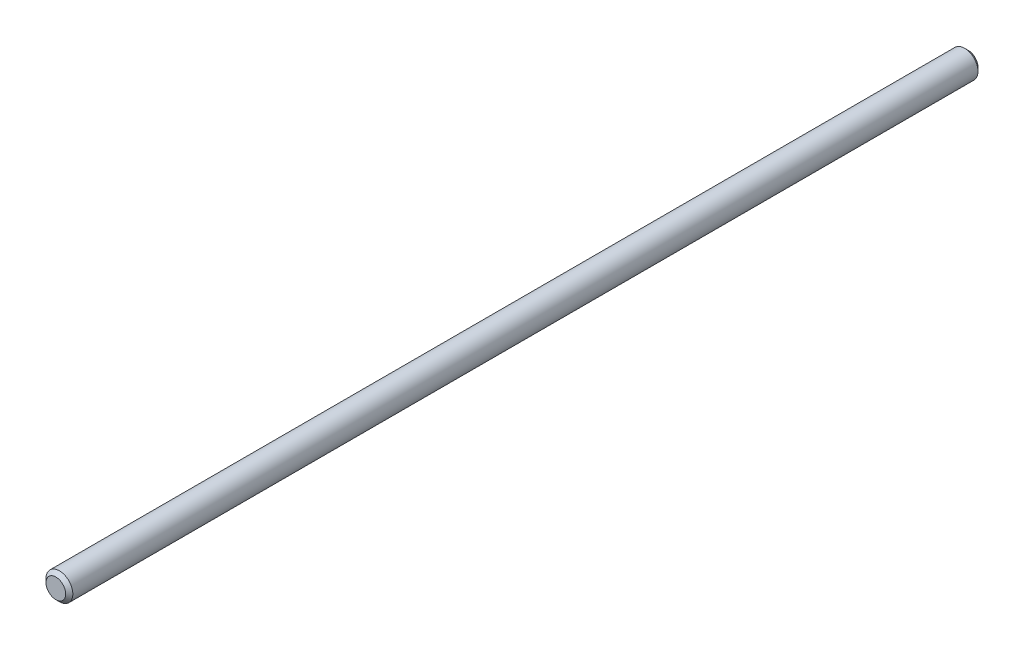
ISO-10303-21;
HEADER;
FILE_DESCRIPTION(('STEP AP214'),'2;1');
FILE_NAME('part.step','',(''),(''),'','','');
FILE_SCHEMA(('AUTOMOTIVE_DESIGN { 1 0 10303 214 1 1 1 1 }'));
ENDSEC;
DATA;
#1=APPLICATION_CONTEXT('core data for automotive mechanical design processes');
#2=APPLICATION_PROTOCOL_DEFINITION('international standard','automotive_design',2000,#1);
#3=PRODUCT_CONTEXT('',#1,'mechanical');
#4=PRODUCT('Part','Part','',(#3));
#5=PRODUCT_RELATED_PRODUCT_CATEGORY('part','',(#4));
#6=PRODUCT_DEFINITION_FORMATION('','',#4);
#7=PRODUCT_DEFINITION_CONTEXT('part definition',#1,'design');
#8=PRODUCT_DEFINITION('design','',#6,#7);
#9=PRODUCT_DEFINITION_SHAPE('','',#8);
#10=(LENGTH_UNIT() NAMED_UNIT(*) SI_UNIT(.MILLI.,.METRE.));
#11=(NAMED_UNIT(*) PLANE_ANGLE_UNIT() SI_UNIT($,.RADIAN.));
#12=(NAMED_UNIT(*) SI_UNIT($,.STERADIAN.) SOLID_ANGLE_UNIT());
#13=UNCERTAINTY_MEASURE_WITH_UNIT(LENGTH_MEASURE(1.E-05),#10,'distance_accuracy_value','');
#14=(GEOMETRIC_REPRESENTATION_CONTEXT(3) GLOBAL_UNCERTAINTY_ASSIGNED_CONTEXT((#13)) GLOBAL_UNIT_ASSIGNED_CONTEXT((#10,
#11,#12)) REPRESENTATION_CONTEXT('',''));
#15=CARTESIAN_POINT('',(0.,0.,0.));
#16=DIRECTION('',(0.,0.,1.));
#17=DIRECTION('',(1.,0.,0.));
#18=AXIS2_PLACEMENT_3D('',#15,#16,#17);
#19=CARTESIAN_POINT('',(0.,0.,51.));
#20=DIRECTION('',(0.,0.,-1.));
#21=DIRECTION('',(-1.,0.,0.));
#22=AXIS2_PLACEMENT_3D('',#19,#20,#21);
#23=CYLINDRICAL_SURFACE('',#22,0.75);
#24=CARTESIAN_POINT('',(0.,0.,0.199999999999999));
#25=DIRECTION('',(0.,0.,1.));
#26=DIRECTION('',(1.,0.,0.));
#27=AXIS2_PLACEMENT_3D('',#24,#25,#26);
#28=CIRCLE('',#27,0.75);
#29=CARTESIAN_POINT('',(0.75,0.,0.199999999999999));
#30=VERTEX_POINT('',#29);
#31=EDGE_CURVE('E42',#30,#30,#28,.T.);
#32=ORIENTED_EDGE('',*,*,#31,.T.);
#33=EDGE_LOOP('',(#32));
#34=FACE_BOUND('',#33,.T.);
#35=CARTESIAN_POINT('',(0.,0.,50.8));
#36=DIRECTION('',(0.,0.,1.));
#37=DIRECTION('',(1.,0.,0.));
#38=AXIS2_PLACEMENT_3D('',#35,#36,#37);
#39=CIRCLE('',#38,0.75);
#40=CARTESIAN_POINT('',(0.75,0.,50.8));
#41=VERTEX_POINT('',#40);
#42=EDGE_CURVE('E46',#41,#41,#39,.F.);
#43=ORIENTED_EDGE('',*,*,#42,.T.);
#44=EDGE_LOOP('',(#43));
#45=FACE_BOUND('',#44,.T.);
#46=ADVANCED_FACE('F32',(#34,#45),#23,.T.);
#47=CARTESIAN_POINT('',(0.,0.,51.));
#48=DIRECTION('',(0.,0.,1.));
#49=DIRECTION('',(1.,0.,0.));
#50=AXIS2_PLACEMENT_3D('',#47,#48,#49);
#51=PLANE('',#50);
#52=CARTESIAN_POINT('',(0.,0.,51.));
#53=DIRECTION('',(0.,0.,1.));
#54=DIRECTION('',(1.,0.,0.));
#55=AXIS2_PLACEMENT_3D('',#52,#53,#54);
#56=CIRCLE('',#55,0.550000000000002);
#57=CARTESIAN_POINT('',(0.550000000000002,0.,51.));
#58=VERTEX_POINT('',#57);
#59=EDGE_CURVE('E10',#58,#58,#56,.T.);
#60=ORIENTED_EDGE('',*,*,#59,.T.);
#61=EDGE_LOOP('',(#60));
#62=FACE_BOUND('',#61,.T.);
#63=ADVANCED_FACE('F65',(#62),#51,.T.);
#64=CARTESIAN_POINT('',(0.,0.,0.));
#65=DIRECTION('',(0.,0.,1.));
#66=DIRECTION('',(1.,0.,0.));
#67=AXIS2_PLACEMENT_3D('',#64,#65,#66);
#68=PLANE('',#67);
#69=CARTESIAN_POINT('',(0.,0.,0.));
#70=DIRECTION('',(0.,0.,1.));
#71=DIRECTION('',(1.,0.,0.));
#72=AXIS2_PLACEMENT_3D('',#69,#70,#71);
#73=CIRCLE('',#72,0.550000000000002);
#74=CARTESIAN_POINT('',(0.550000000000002,0.,0.));
#75=VERTEX_POINT('',#74);
#76=EDGE_CURVE('E38',#75,#75,#73,.F.);
#77=ORIENTED_EDGE('',*,*,#76,.T.);
#78=EDGE_LOOP('',(#77));
#79=FACE_BOUND('',#78,.T.);
#80=ADVANCED_FACE('F61',(#79),#68,.F.);
#81=CARTESIAN_POINT('',(0.,0.,0.199999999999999));
#82=DIRECTION('',(0.,0.,1.));
#83=DIRECTION('',(1.,0.,0.));
#84=AXIS2_PLACEMENT_3D('',#81,#82,#83);
#85=CONICAL_SURFACE('',#84,0.75,0.785398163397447);
#86=ORIENTED_EDGE('',*,*,#76,.F.);
#87=EDGE_LOOP('',(#86));
#88=FACE_BOUND('',#87,.T.);
#89=ORIENTED_EDGE('',*,*,#31,.F.);
#90=EDGE_LOOP('',(#89));
#91=FACE_BOUND('',#90,.T.);
#92=ADVANCED_FACE('F56',(#88,#91),#85,.T.);
#93=CARTESIAN_POINT('',(0.,0.,51.));
#94=DIRECTION('',(0.,0.,-1.));
#95=DIRECTION('',(-1.,0.,0.));
#96=AXIS2_PLACEMENT_3D('',#93,#94,#95);
#97=CONICAL_SURFACE('',#96,0.550000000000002,0.785398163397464);
#98=ORIENTED_EDGE('',*,*,#42,.F.);
#99=EDGE_LOOP('',(#98));
#100=FACE_BOUND('',#99,.T.);
#101=ORIENTED_EDGE('',*,*,#59,.F.);
#102=EDGE_LOOP('',(#101));
#103=FACE_BOUND('',#102,.T.);
#104=ADVANCED_FACE('F53',(#100,#103),#97,.T.);
#105=CLOSED_SHELL('',(#46,#63,#80,#92,#104));
#106=MANIFOLD_SOLID_BREP('B2',#105);
#107=ADVANCED_BREP_SHAPE_REPRESENTATION('',(#18,#106),#14);
#108=SHAPE_DEFINITION_REPRESENTATION(#9,#107);
ENDSEC;
END-ISO-10303-21;
